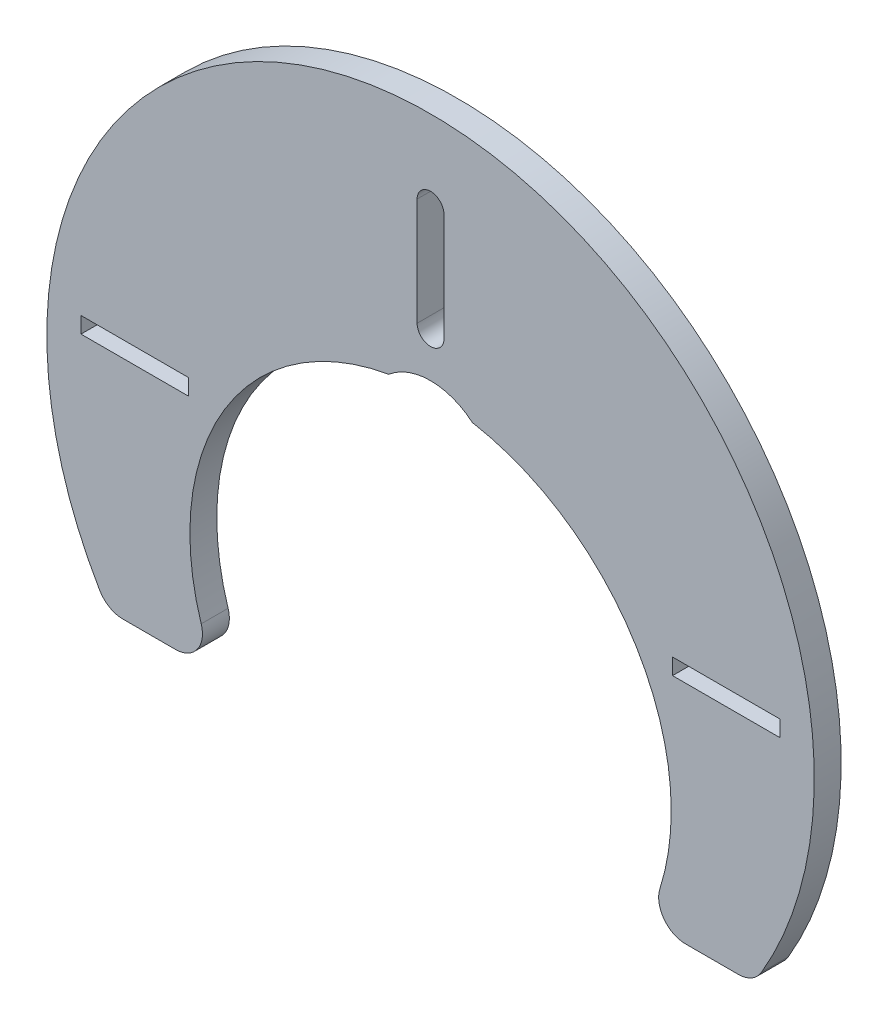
ISO-10303-21;
HEADER;
FILE_DESCRIPTION(('STEP AP214'),'2;1');
FILE_NAME('part.step','',(''),(''),'','','');
FILE_SCHEMA(('AUTOMOTIVE_DESIGN { 1 0 10303 214 1 1 1 1 }'));
ENDSEC;
DATA;
#1=APPLICATION_CONTEXT('core data for automotive mechanical design processes');
#2=APPLICATION_PROTOCOL_DEFINITION('international standard','automotive_design',2000,#1);
#3=PRODUCT_CONTEXT('',#1,'mechanical');
#4=PRODUCT('Part','Part','',(#3));
#5=PRODUCT_RELATED_PRODUCT_CATEGORY('part','',(#4));
#6=PRODUCT_DEFINITION_FORMATION('','',#4);
#7=PRODUCT_DEFINITION_CONTEXT('part definition',#1,'design');
#8=PRODUCT_DEFINITION('design','',#6,#7);
#9=PRODUCT_DEFINITION_SHAPE('','',#8);
#10=(LENGTH_UNIT() NAMED_UNIT(*) SI_UNIT(.MILLI.,.METRE.));
#11=(NAMED_UNIT(*) PLANE_ANGLE_UNIT() SI_UNIT($,.RADIAN.));
#12=(NAMED_UNIT(*) SI_UNIT($,.STERADIAN.) SOLID_ANGLE_UNIT());
#13=UNCERTAINTY_MEASURE_WITH_UNIT(LENGTH_MEASURE(1.E-05),#10,'distance_accuracy_value','');
#14=(GEOMETRIC_REPRESENTATION_CONTEXT(3) GLOBAL_UNCERTAINTY_ASSIGNED_CONTEXT((#13)) GLOBAL_UNIT_ASSIGNED_CONTEXT((#10,
#11,#12)) REPRESENTATION_CONTEXT('',''));
#15=CARTESIAN_POINT('',(0.,0.,0.));
#16=DIRECTION('',(0.,0.,1.));
#17=DIRECTION('',(1.,0.,0.));
#18=AXIS2_PLACEMENT_3D('',#15,#16,#17);
#19=CARTESIAN_POINT('',(-1.5997211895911,-10.4141067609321,5.));
#20=DIRECTION('',(0.,0.,-1.));
#21=DIRECTION('',(-1.,0.,0.));
#22=AXIS2_PLACEMENT_3D('',#19,#20,#21);
#23=CYLINDRICAL_SURFACE('',#22,44.7545011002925);
#24=CARTESIAN_POINT('',(-1.5997211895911,-10.4141067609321,0.));
#25=DIRECTION('',(0.,0.,-1.));
#26=DIRECTION('',(-1.,0.,0.));
#27=AXIS2_PLACEMENT_3D('',#24,#25,#26);
#28=CIRCLE('',#27,44.7545011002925);
#29=CARTESIAN_POINT('',(6.16424102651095,33.6618079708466,0.));
#30=VERTEX_POINT('',#29);
#31=CARTESIAN_POINT('',(41.0513579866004,-23.9732665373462,0.));
#32=VERTEX_POINT('',#31);
#33=EDGE_CURVE('E281',#30,#32,#28,.T.);
#34=ORIENTED_EDGE('',*,*,#33,.T.);
#35=DIRECTION('',(0.,0.,-1.));
#36=VECTOR('',#35,1.);
#37=CARTESIAN_POINT('',(41.0513579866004,-23.9732665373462,5.));
#38=LINE('',#37,#36);
#39=CARTESIAN_POINT('',(41.0513579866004,-23.9732665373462,5.));
#40=VERTEX_POINT('',#39);
#41=EDGE_CURVE('E206',#32,#40,#38,.F.);
#42=ORIENTED_EDGE('',*,*,#41,.T.);
#43=CARTESIAN_POINT('',(-1.5997211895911,-10.4141067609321,5.));
#44=DIRECTION('',(0.,0.,-1.));
#45=DIRECTION('',(-1.,0.,0.));
#46=AXIS2_PLACEMENT_3D('',#43,#44,#45);
#47=CIRCLE('',#46,44.7545011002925);
#48=CARTESIAN_POINT('',(6.16424102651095,33.6618079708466,5.));
#49=VERTEX_POINT('',#48);
#50=EDGE_CURVE('E200',#49,#40,#47,.T.);
#51=ORIENTED_EDGE('',*,*,#50,.F.);
#52=DIRECTION('',(0.,0.,1.));
#53=VECTOR('',#52,1.);
#54=CARTESIAN_POINT('',(6.16424102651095,33.6618079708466,2.));
#55=LINE('',#54,#53);
#56=EDGE_CURVE('E182',#49,#30,#55,.F.);
#57=ORIENTED_EDGE('',*,*,#56,.T.);
#58=EDGE_LOOP('',(#34,#42,#51,#57));
#59=FACE_BOUND('',#58,.T.);
#60=ADVANCED_FACE('F31',(#59),#23,.F.);
#61=CARTESIAN_POINT('',(-1.59972118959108,8.1333026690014,5.));
#62=DIRECTION('',(0.,0.,-1.));
#63=DIRECTION('',(-1.,0.,0.));
#64=AXIS2_PLACEMENT_3D('',#61,#62,#63);
#65=CYLINDRICAL_SURFACE('',#64,71.3555397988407);
#66=CARTESIAN_POINT('',(-1.59972118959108,8.1333026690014,5.));
#67=DIRECTION('',(0.,0.,1.));
#68=DIRECTION('',(-1.,0.,0.));
#69=AXIS2_PLACEMENT_3D('',#66,#67,#68);
#70=CIRCLE('',#69,71.3555397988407);
#71=CARTESIAN_POINT('',(59.9180886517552,-28.0215328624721,5.));
#72=VERTEX_POINT('',#71);
#73=CARTESIAN_POINT('',(-63.1175310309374,-28.0215328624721,5.));
#74=VERTEX_POINT('',#73);
#75=EDGE_CURVE('E210',#72,#74,#70,.T.);
#76=ORIENTED_EDGE('',*,*,#75,.F.);
#77=DIRECTION('',(0.,0.,-1.));
#78=VECTOR('',#77,1.);
#79=CARTESIAN_POINT('',(59.9180886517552,-28.0215328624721,5.));
#80=LINE('',#79,#78);
#81=CARTESIAN_POINT('',(59.9180886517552,-28.0215328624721,0.));
#82=VERTEX_POINT('',#81);
#83=EDGE_CURVE('E245',#72,#82,#80,.T.);
#84=ORIENTED_EDGE('',*,*,#83,.T.);
#85=CARTESIAN_POINT('',(-1.59972118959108,8.1333026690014,0.));
#86=DIRECTION('',(0.,0.,1.));
#87=DIRECTION('',(-1.,0.,0.));
#88=AXIS2_PLACEMENT_3D('',#85,#86,#87);
#89=CIRCLE('',#88,71.3555397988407);
#90=CARTESIAN_POINT('',(-63.1175310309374,-28.0215328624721,0.));
#91=VERTEX_POINT('',#90);
#92=EDGE_CURVE('E282',#82,#91,#89,.T.);
#93=ORIENTED_EDGE('',*,*,#92,.T.);
#94=DIRECTION('',(0.,0.,-1.));
#95=VECTOR('',#94,1.);
#96=CARTESIAN_POINT('',(-63.1175310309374,-28.0215328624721,5.));
#97=LINE('',#96,#95);
#98=EDGE_CURVE('E243',#91,#74,#97,.F.);
#99=ORIENTED_EDGE('',*,*,#98,.T.);
#100=EDGE_LOOP('',(#76,#84,#93,#99));
#101=FACE_BOUND('',#100,.T.);
#102=ADVANCED_FACE('F33',(#101),#65,.T.);
#103=CARTESIAN_POINT('',(-61.5997211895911,-30.4881040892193,5.));
#104=DIRECTION('',(0.,1.,0.));
#105=DIRECTION('',(0.,0.,1.));
#106=AXIS2_PLACEMENT_3D('',#103,#104,#105);
#107=PLANE('',#106);
#108=DIRECTION('',(1.,0.,0.));
#109=VECTOR('',#108,1.);
#110=CARTESIAN_POINT('',(-61.5997211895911,-30.4881040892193,5.));
#111=LINE('',#110,#109);
#112=CARTESIAN_POINT('',(-58.8068769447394,-30.4881040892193,5.));
#113=VERTEX_POINT('',#112);
#114=CARTESIAN_POINT('',(-49.0158047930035,-30.4881040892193,5.));
#115=VERTEX_POINT('',#114);
#116=EDGE_CURVE('E207',#113,#115,#111,.T.);
#117=ORIENTED_EDGE('',*,*,#116,.F.);
#118=DIRECTION('',(0.,0.,-1.));
#119=VECTOR('',#118,1.);
#120=CARTESIAN_POINT('',(-58.8068769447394,-30.4881040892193,5.));
#121=LINE('',#120,#119);
#122=CARTESIAN_POINT('',(-58.8068769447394,-30.4881040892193,0.));
#123=VERTEX_POINT('',#122);
#124=EDGE_CURVE('E39',#113,#123,#121,.T.);
#125=ORIENTED_EDGE('',*,*,#124,.T.);
#126=DIRECTION('',(1.,0.,0.));
#127=VECTOR('',#126,1.);
#128=CARTESIAN_POINT('',(-61.5997211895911,-30.4881040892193,0.));
#129=LINE('',#128,#127);
#130=CARTESIAN_POINT('',(-49.0158047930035,-30.4881040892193,0.));
#131=VERTEX_POINT('',#130);
#132=EDGE_CURVE('E273',#123,#131,#129,.T.);
#133=ORIENTED_EDGE('',*,*,#132,.T.);
#134=DIRECTION('',(0.,0.,-1.));
#135=VECTOR('',#134,1.);
#136=CARTESIAN_POINT('',(-49.0158047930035,-30.4881040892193,5.));
#137=LINE('',#136,#135);
#138=EDGE_CURVE('E46',#131,#115,#137,.F.);
#139=ORIENTED_EDGE('',*,*,#138,.T.);
#140=EDGE_LOOP('',(#117,#125,#133,#139));
#141=FACE_BOUND('',#140,.T.);
#142=ADVANCED_FACE('F272',(#141),#107,.F.);
#143=CARTESIAN_POINT('',(-44.2508003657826,-23.9732665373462,5.));
#144=VERTEX_POINT('',#143);
#145=CARTESIAN_POINT('',(-9.36368340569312,33.6618079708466,5.));
#146=VERTEX_POINT('',#145);
#147=EDGE_CURVE('E203',#144,#146,#47,.T.);
#148=ORIENTED_EDGE('',*,*,#147,.F.);
#149=DIRECTION('',(0.,0.,-1.));
#150=VECTOR('',#149,1.);
#151=CARTESIAN_POINT('',(-44.2508003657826,-23.9732665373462,5.));
#152=LINE('',#151,#150);
#153=CARTESIAN_POINT('',(-44.2508003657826,-23.9732665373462,0.));
#154=VERTEX_POINT('',#153);
#155=EDGE_CURVE('E11',#144,#154,#152,.T.);
#156=ORIENTED_EDGE('',*,*,#155,.T.);
#157=CARTESIAN_POINT('',(-9.36368340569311,33.6618079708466,0.));
#158=VERTEX_POINT('',#157);
#159=EDGE_CURVE('E284',#154,#158,#28,.T.);
#160=ORIENTED_EDGE('',*,*,#159,.T.);
#161=DIRECTION('',(0.,0.,1.));
#162=VECTOR('',#161,1.);
#163=CARTESIAN_POINT('',(-9.36368340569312,33.6618079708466,2.));
#164=LINE('',#163,#162);
#165=EDGE_CURVE('E195',#158,#146,#164,.T.);
#166=ORIENTED_EDGE('',*,*,#165,.T.);
#167=EDGE_LOOP('',(#148,#156,#160,#166));
#168=FACE_BOUND('',#167,.T.);
#169=ADVANCED_FACE('F320',(#168),#23,.F.);
#170=CARTESIAN_POINT('',(38.4002788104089,-30.4881040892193,5.));
#171=DIRECTION('',(0.,1.,0.));
#172=DIRECTION('',(0.,0.,1.));
#173=AXIS2_PLACEMENT_3D('',#170,#171,#172);
#174=PLANE('',#173);
#175=DIRECTION('',(1.,0.,0.));
#176=VECTOR('',#175,1.);
#177=CARTESIAN_POINT('',(38.4002788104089,-30.4881040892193,0.));
#178=LINE('',#177,#176);
#179=CARTESIAN_POINT('',(45.8163624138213,-30.4881040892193,0.));
#180=VERTEX_POINT('',#179);
#181=CARTESIAN_POINT('',(55.6074345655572,-30.4881040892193,0.));
#182=VERTEX_POINT('',#181);
#183=EDGE_CURVE('E290',#180,#182,#178,.T.);
#184=ORIENTED_EDGE('',*,*,#183,.T.);
#185=DIRECTION('',(0.,0.,-1.));
#186=VECTOR('',#185,1.);
#187=CARTESIAN_POINT('',(55.6074345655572,-30.4881040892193,5.));
#188=LINE('',#187,#186);
#189=CARTESIAN_POINT('',(55.6074345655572,-30.4881040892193,5.));
#190=VERTEX_POINT('',#189);
#191=EDGE_CURVE('E259',#182,#190,#188,.F.);
#192=ORIENTED_EDGE('',*,*,#191,.T.);
#193=DIRECTION('',(1.,0.,0.));
#194=VECTOR('',#193,1.);
#195=CARTESIAN_POINT('',(38.4002788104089,-30.4881040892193,5.));
#196=LINE('',#195,#194);
#197=CARTESIAN_POINT('',(45.8163624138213,-30.4881040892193,5.));
#198=VERTEX_POINT('',#197);
#199=EDGE_CURVE('E209',#198,#190,#196,.T.);
#200=ORIENTED_EDGE('',*,*,#199,.F.);
#201=DIRECTION('',(0.,0.,-1.));
#202=VECTOR('',#201,1.);
#203=CARTESIAN_POINT('',(45.8163624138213,-30.4881040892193,5.));
#204=LINE('',#203,#202);
#205=EDGE_CURVE('E256',#198,#180,#204,.T.);
#206=ORIENTED_EDGE('',*,*,#205,.T.);
#207=EDGE_LOOP('',(#184,#192,#200,#206));
#208=FACE_BOUND('',#207,.T.);
#209=ADVANCED_FACE('F302',(#208),#174,.F.);
#210=CARTESIAN_POINT('',(-1.59972118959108,8.1333026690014,5.));
#211=DIRECTION('',(0.,0.,-1.));
#212=DIRECTION('',(-1.,0.,0.));
#213=AXIS2_PLACEMENT_3D('',#210,#211,#212);
#214=PLANE('',#213);
#215=DIRECTION('',(0.,-1.,0.));
#216=VECTOR('',#215,1.);
#217=CARTESIAN_POINT('',(-4.09972118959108,64.5118959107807,5.));
#218=LINE('',#217,#216);
#219=CARTESIAN_POINT('',(-4.09972118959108,64.5118959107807,5.));
#220=VERTEX_POINT('',#219);
#221=CARTESIAN_POINT('',(-4.09972118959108,44.5118959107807,5.));
#222=VERTEX_POINT('',#221);
#223=EDGE_CURVE('E483',#220,#222,#218,.T.);
#224=ORIENTED_EDGE('',*,*,#223,.F.);
#225=CARTESIAN_POINT('',(-1.59972118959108,64.5118959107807,5.));
#226=DIRECTION('',(0.,0.,1.));
#227=DIRECTION('',(-1.,0.,0.));
#228=AXIS2_PLACEMENT_3D('',#225,#226,#227);
#229=CIRCLE('',#228,2.5);
#230=CARTESIAN_POINT('',(0.900278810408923,64.5118959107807,5.));
#231=VERTEX_POINT('',#230);
#232=EDGE_CURVE('E194',#231,#220,#229,.T.);
#233=ORIENTED_EDGE('',*,*,#232,.F.);
#234=DIRECTION('',(0.,1.,0.));
#235=VECTOR('',#234,1.);
#236=CARTESIAN_POINT('',(0.900278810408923,64.5118959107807,5.));
#237=LINE('',#236,#235);
#238=CARTESIAN_POINT('',(0.900278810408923,44.5118959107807,5.));
#239=VERTEX_POINT('',#238);
#240=EDGE_CURVE('E544',#239,#231,#237,.T.);
#241=ORIENTED_EDGE('',*,*,#240,.F.);
#242=CARTESIAN_POINT('',(-1.59972118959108,44.5118959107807,5.));
#243=DIRECTION('',(0.,0.,1.));
#244=DIRECTION('',(1.,0.,0.));
#245=AXIS2_PLACEMENT_3D('',#242,#243,#244);
#246=CIRCLE('',#245,2.5);
#247=EDGE_CURVE('E551',#222,#239,#246,.T.);
#248=ORIENTED_EDGE('',*,*,#247,.F.);
#249=EDGE_LOOP('',(#224,#233,#241,#248));
#250=FACE_BOUND('',#249,.T.);
#251=DIRECTION('',(0.,-1.,0.));
#252=VECTOR('',#251,1.);
#253=CARTESIAN_POINT('',(43.4002788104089,14.5118959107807,5.));
#254=LINE('',#253,#252);
#255=CARTESIAN_POINT('',(43.4002788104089,14.5118959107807,5.));
#256=VERTEX_POINT('',#255);
#257=CARTESIAN_POINT('',(43.4002788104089,11.5118959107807,5.));
#258=VERTEX_POINT('',#257);
#259=EDGE_CURVE('E489',#256,#258,#254,.T.);
#260=ORIENTED_EDGE('',*,*,#259,.F.);
#261=DIRECTION('',(-1.,0.,0.));
#262=VECTOR('',#261,1.);
#263=CARTESIAN_POINT('',(43.4002788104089,14.5118959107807,5.));
#264=LINE('',#263,#262);
#265=CARTESIAN_POINT('',(63.4002788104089,14.5118959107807,5.));
#266=VERTEX_POINT('',#265);
#267=EDGE_CURVE('E537',#266,#256,#264,.T.);
#268=ORIENTED_EDGE('',*,*,#267,.F.);
#269=DIRECTION('',(0.,1.,0.));
#270=VECTOR('',#269,1.);
#271=CARTESIAN_POINT('',(63.4002788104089,14.5118959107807,5.));
#272=LINE('',#271,#270);
#273=CARTESIAN_POINT('',(63.4002788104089,11.5118959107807,5.));
#274=VERTEX_POINT('',#273);
#275=EDGE_CURVE('E526',#274,#266,#272,.T.);
#276=ORIENTED_EDGE('',*,*,#275,.F.);
#277=DIRECTION('',(1.,0.,0.));
#278=VECTOR('',#277,1.);
#279=CARTESIAN_POINT('',(43.4002788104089,11.5118959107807,5.));
#280=LINE('',#279,#278);
#281=EDGE_CURVE('E533',#258,#274,#280,.T.);
#282=ORIENTED_EDGE('',*,*,#281,.F.);
#283=EDGE_LOOP('',(#260,#268,#276,#282));
#284=FACE_BOUND('',#283,.T.);
#285=DIRECTION('',(1.,0.,0.));
#286=VECTOR('',#285,1.);
#287=CARTESIAN_POINT('',(-66.5997211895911,11.5118959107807,5.));
#288=LINE('',#287,#286);
#289=CARTESIAN_POINT('',(-66.5997211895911,11.5118959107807,5.));
#290=VERTEX_POINT('',#289);
#291=CARTESIAN_POINT('',(-46.5997211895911,11.5118959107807,5.));
#292=VERTEX_POINT('',#291);
#293=EDGE_CURVE('E494',#290,#292,#288,.T.);
#294=ORIENTED_EDGE('',*,*,#293,.F.);
#295=DIRECTION('',(0.,-1.,0.));
#296=VECTOR('',#295,1.);
#297=CARTESIAN_POINT('',(-66.5997211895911,14.5118959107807,5.));
#298=LINE('',#297,#296);
#299=CARTESIAN_POINT('',(-66.5997211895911,14.5118959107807,5.));
#300=VERTEX_POINT('',#299);
#301=EDGE_CURVE('E496',#300,#290,#298,.T.);
#302=ORIENTED_EDGE('',*,*,#301,.F.);
#303=DIRECTION('',(-1.,0.,0.));
#304=VECTOR('',#303,1.);
#305=CARTESIAN_POINT('',(-66.5997211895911,14.5118959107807,5.));
#306=LINE('',#305,#304);
#307=CARTESIAN_POINT('',(-46.5997211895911,14.5118959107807,5.));
#308=VERTEX_POINT('',#307);
#309=EDGE_CURVE('E501',#308,#300,#306,.T.);
#310=ORIENTED_EDGE('',*,*,#309,.F.);
#311=DIRECTION('',(0.,1.,0.));
#312=VECTOR('',#311,1.);
#313=CARTESIAN_POINT('',(-46.5997211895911,14.5118959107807,5.));
#314=LINE('',#313,#312);
#315=EDGE_CURVE('E498',#292,#308,#314,.T.);
#316=ORIENTED_EDGE('',*,*,#315,.F.);
#317=EDGE_LOOP('',(#294,#302,#310,#316));
#318=FACE_BOUND('',#317,.T.);
#319=ORIENTED_EDGE('',*,*,#199,.T.);
#320=CARTESIAN_POINT('',(55.6074345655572,-25.4881040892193,5.));
#321=DIRECTION('',(0.,0.,-1.));
#322=DIRECTION('',(-1.,0.,0.));
#323=AXIS2_PLACEMENT_3D('',#320,#321,#322);
#324=CIRCLE('',#323,5.);
#325=EDGE_CURVE('E266',#190,#72,#324,.F.);
#326=ORIENTED_EDGE('',*,*,#325,.T.);
#327=ORIENTED_EDGE('',*,*,#75,.T.);
#328=CARTESIAN_POINT('',(-58.8068769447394,-25.4881040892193,5.));
#329=DIRECTION('',(0.,0.,-1.));
#330=DIRECTION('',(-1.,0.,0.));
#331=AXIS2_PLACEMENT_3D('',#328,#329,#330);
#332=CIRCLE('',#331,5.);
#333=EDGE_CURVE('E53',#74,#113,#332,.F.);
#334=ORIENTED_EDGE('',*,*,#333,.T.);
#335=ORIENTED_EDGE('',*,*,#116,.T.);
#336=CARTESIAN_POINT('',(-49.0158047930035,-25.4881040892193,5.));
#337=DIRECTION('',(0.,0.,-1.));
#338=DIRECTION('',(-1.,0.,0.));
#339=AXIS2_PLACEMENT_3D('',#336,#337,#338);
#340=CIRCLE('',#339,5.);
#341=EDGE_CURVE('E261',#115,#144,#340,.F.);
#342=ORIENTED_EDGE('',*,*,#341,.T.);
#343=ORIENTED_EDGE('',*,*,#147,.T.);
#344=CARTESIAN_POINT('',(-1.59972118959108,24.5118959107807,5.));
#345=DIRECTION('',(0.,0.,1.));
#346=DIRECTION('',(1.,0.,0.));
#347=AXIS2_PLACEMENT_3D('',#344,#345,#346);
#348=CIRCLE('',#347,12.);
#349=EDGE_CURVE('E186',#49,#146,#348,.T.);
#350=ORIENTED_EDGE('',*,*,#349,.F.);
#351=ORIENTED_EDGE('',*,*,#50,.T.);
#352=CARTESIAN_POINT('',(45.8163624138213,-25.4881040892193,5.));
#353=DIRECTION('',(0.,0.,-1.));
#354=DIRECTION('',(-1.,0.,0.));
#355=AXIS2_PLACEMENT_3D('',#352,#353,#354);
#356=CIRCLE('',#355,5.);
#357=EDGE_CURVE('E264',#40,#198,#356,.F.);
#358=ORIENTED_EDGE('',*,*,#357,.T.);
#359=EDGE_LOOP('',(#319,#326,#327,#334,#335,#342,#343,#350,#351,#358));
#360=FACE_BOUND('',#359,.T.);
#361=ADVANCED_FACE('F199',(#250,#284,#318,#360),#214,.F.);
#362=CARTESIAN_POINT('',(-1.59972118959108,8.1333026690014,0.));
#363=DIRECTION('',(0.,0.,-1.));
#364=DIRECTION('',(-1.,0.,0.));
#365=AXIS2_PLACEMENT_3D('',#362,#363,#364);
#366=PLANE('',#365);
#367=ORIENTED_EDGE('',*,*,#92,.F.);
#368=CARTESIAN_POINT('',(55.6074345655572,-25.4881040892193,0.));
#369=DIRECTION('',(0.,0.,-1.));
#370=DIRECTION('',(-1.,0.,0.));
#371=AXIS2_PLACEMENT_3D('',#368,#369,#370);
#372=CIRCLE('',#371,5.);
#373=EDGE_CURVE('E254',#82,#182,#372,.T.);
#374=ORIENTED_EDGE('',*,*,#373,.T.);
#375=ORIENTED_EDGE('',*,*,#183,.F.);
#376=CARTESIAN_POINT('',(45.8163624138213,-25.4881040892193,0.));
#377=DIRECTION('',(0.,0.,-1.));
#378=DIRECTION('',(-1.,0.,0.));
#379=AXIS2_PLACEMENT_3D('',#376,#377,#378);
#380=CIRCLE('',#379,5.);
#381=EDGE_CURVE('E252',#180,#32,#380,.T.);
#382=ORIENTED_EDGE('',*,*,#381,.T.);
#383=ORIENTED_EDGE('',*,*,#33,.F.);
#384=CARTESIAN_POINT('',(-1.59972118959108,24.5118959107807,0.));
#385=DIRECTION('',(0.,0.,-1.));
#386=DIRECTION('',(-1.,0.,0.));
#387=AXIS2_PLACEMENT_3D('',#384,#385,#386);
#388=CIRCLE('',#387,12.);
#389=EDGE_CURVE('E189',#158,#30,#388,.T.);
#390=ORIENTED_EDGE('',*,*,#389,.F.);
#391=ORIENTED_EDGE('',*,*,#159,.F.);
#392=CARTESIAN_POINT('',(-49.0158047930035,-25.4881040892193,0.));
#393=DIRECTION('',(0.,0.,-1.));
#394=DIRECTION('',(-1.,0.,0.));
#395=AXIS2_PLACEMENT_3D('',#392,#393,#394);
#396=CIRCLE('',#395,5.);
#397=EDGE_CURVE('E248',#154,#131,#396,.T.);
#398=ORIENTED_EDGE('',*,*,#397,.T.);
#399=ORIENTED_EDGE('',*,*,#132,.F.);
#400=CARTESIAN_POINT('',(-58.8068769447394,-25.4881040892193,0.));
#401=DIRECTION('',(0.,0.,-1.));
#402=DIRECTION('',(-1.,0.,0.));
#403=AXIS2_PLACEMENT_3D('',#400,#401,#402);
#404=CIRCLE('',#403,5.);
#405=EDGE_CURVE('E250',#123,#91,#404,.T.);
#406=ORIENTED_EDGE('',*,*,#405,.T.);
#407=EDGE_LOOP('',(#367,#374,#375,#382,#383,#390,#391,#398,#399,#406));
#408=FACE_BOUND('',#407,.T.);
#409=CARTESIAN_POINT('',(-1.59972118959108,64.5118959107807,0.));
#410=DIRECTION('',(0.,0.,-1.));
#411=DIRECTION('',(-1.,0.,0.));
#412=AXIS2_PLACEMENT_3D('',#409,#410,#411);
#413=CIRCLE('',#412,2.5);
#414=CARTESIAN_POINT('',(-4.09972118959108,64.5118959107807,0.));
#415=VERTEX_POINT('',#414);
#416=CARTESIAN_POINT('',(0.900278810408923,64.5118959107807,0.));
#417=VERTEX_POINT('',#416);
#418=EDGE_CURVE('E240',#415,#417,#413,.T.);
#419=ORIENTED_EDGE('',*,*,#418,.F.);
#420=DIRECTION('',(0.,1.,0.));
#421=VECTOR('',#420,1.);
#422=CARTESIAN_POINT('',(-4.09972118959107,8.1333026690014,0.));
#423=LINE('',#422,#421);
#424=CARTESIAN_POINT('',(-4.09972118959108,44.5118959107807,0.));
#425=VERTEX_POINT('',#424);
#426=EDGE_CURVE('E233',#425,#415,#423,.T.);
#427=ORIENTED_EDGE('',*,*,#426,.F.);
#428=CARTESIAN_POINT('',(-1.59972118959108,44.5118959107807,0.));
#429=DIRECTION('',(0.,0.,-1.));
#430=DIRECTION('',(-1.,0.,0.));
#431=AXIS2_PLACEMENT_3D('',#428,#429,#430);
#432=CIRCLE('',#431,2.5);
#433=CARTESIAN_POINT('',(0.900278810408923,44.5118959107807,0.));
#434=VERTEX_POINT('',#433);
#435=EDGE_CURVE('E235',#434,#425,#432,.T.);
#436=ORIENTED_EDGE('',*,*,#435,.F.);
#437=DIRECTION('',(0.,-1.,0.));
#438=VECTOR('',#437,1.);
#439=CARTESIAN_POINT('',(0.90027881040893,8.1333026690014,0.));
#440=LINE('',#439,#438);
#441=EDGE_CURVE('E238',#417,#434,#440,.T.);
#442=ORIENTED_EDGE('',*,*,#441,.F.);
#443=EDGE_LOOP('',(#419,#427,#436,#442));
#444=FACE_BOUND('',#443,.T.);
#445=DIRECTION('',(1.,0.,0.));
#446=VECTOR('',#445,1.);
#447=CARTESIAN_POINT('',(-1.59972118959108,14.5118959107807,0.));
#448=LINE('',#447,#446);
#449=CARTESIAN_POINT('',(43.4002788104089,14.5118959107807,0.));
#450=VERTEX_POINT('',#449);
#451=CARTESIAN_POINT('',(63.4002788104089,14.5118959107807,0.));
#452=VERTEX_POINT('',#451);
#453=EDGE_CURVE('E231',#450,#452,#448,.T.);
#454=ORIENTED_EDGE('',*,*,#453,.F.);
#455=DIRECTION('',(0.,1.,0.));
#456=VECTOR('',#455,1.);
#457=CARTESIAN_POINT('',(43.4002788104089,8.1333026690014,0.));
#458=LINE('',#457,#456);
#459=CARTESIAN_POINT('',(43.4002788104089,11.5118959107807,0.));
#460=VERTEX_POINT('',#459);
#461=EDGE_CURVE('E224',#460,#450,#458,.T.);
#462=ORIENTED_EDGE('',*,*,#461,.F.);
#463=DIRECTION('',(-1.,0.,0.));
#464=VECTOR('',#463,1.);
#465=CARTESIAN_POINT('',(-1.59972118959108,11.5118959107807,0.));
#466=LINE('',#465,#464);
#467=CARTESIAN_POINT('',(63.4002788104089,11.5118959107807,0.));
#468=VERTEX_POINT('',#467);
#469=EDGE_CURVE('E226',#468,#460,#466,.T.);
#470=ORIENTED_EDGE('',*,*,#469,.F.);
#471=DIRECTION('',(0.,-1.,0.));
#472=VECTOR('',#471,1.);
#473=CARTESIAN_POINT('',(63.4002788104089,8.1333026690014,0.));
#474=LINE('',#473,#472);
#475=EDGE_CURVE('E229',#452,#468,#474,.T.);
#476=ORIENTED_EDGE('',*,*,#475,.F.);
#477=EDGE_LOOP('',(#454,#462,#470,#476));
#478=FACE_BOUND('',#477,.T.);
#479=DIRECTION('',(0.,1.,0.));
#480=VECTOR('',#479,1.);
#481=CARTESIAN_POINT('',(-66.5997211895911,8.1333026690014,0.));
#482=LINE('',#481,#480);
#483=CARTESIAN_POINT('',(-66.5997211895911,11.5118959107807,0.));
#484=VERTEX_POINT('',#483);
#485=CARTESIAN_POINT('',(-66.5997211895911,14.5118959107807,0.));
#486=VERTEX_POINT('',#485);
#487=EDGE_CURVE('E222',#484,#486,#482,.T.);
#488=ORIENTED_EDGE('',*,*,#487,.F.);
#489=DIRECTION('',(-1.,0.,0.));
#490=VECTOR('',#489,1.);
#491=CARTESIAN_POINT('',(-1.59972118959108,11.5118959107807,0.));
#492=LINE('',#491,#490);
#493=CARTESIAN_POINT('',(-46.5997211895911,11.5118959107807,0.));
#494=VERTEX_POINT('',#493);
#495=EDGE_CURVE('E215',#494,#484,#492,.T.);
#496=ORIENTED_EDGE('',*,*,#495,.F.);
#497=DIRECTION('',(0.,-1.,0.));
#498=VECTOR('',#497,1.);
#499=CARTESIAN_POINT('',(-46.5997211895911,8.1333026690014,0.));
#500=LINE('',#499,#498);
#501=CARTESIAN_POINT('',(-46.5997211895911,14.5118959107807,0.));
#502=VERTEX_POINT('',#501);
#503=EDGE_CURVE('E217',#502,#494,#500,.T.);
#504=ORIENTED_EDGE('',*,*,#503,.F.);
#505=DIRECTION('',(1.,0.,0.));
#506=VECTOR('',#505,1.);
#507=CARTESIAN_POINT('',(-1.59972118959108,14.5118959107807,0.));
#508=LINE('',#507,#506);
#509=EDGE_CURVE('E220',#486,#502,#508,.T.);
#510=ORIENTED_EDGE('',*,*,#509,.F.);
#511=EDGE_LOOP('',(#488,#496,#504,#510));
#512=FACE_BOUND('',#511,.T.);
#513=ADVANCED_FACE('F277',(#408,#444,#478,#512),#366,.T.);
#514=CARTESIAN_POINT('',(-66.5997211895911,14.5118959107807,-1.));
#515=DIRECTION('',(-1.,0.,0.));
#516=DIRECTION('',(0.,0.,1.));
#517=AXIS2_PLACEMENT_3D('',#514,#515,#516);
#518=PLANE('',#517);
#519=ORIENTED_EDGE('',*,*,#487,.T.);
#520=DIRECTION('',(0.,0.,1.));
#521=VECTOR('',#520,1.);
#522=CARTESIAN_POINT('',(-66.5997211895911,14.5118959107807,-1.));
#523=LINE('',#522,#521);
#524=EDGE_CURVE('E286',#486,#300,#523,.T.);
#525=ORIENTED_EDGE('',*,*,#524,.T.);
#526=ORIENTED_EDGE('',*,*,#301,.T.);
#527=DIRECTION('',(0.,0.,1.));
#528=VECTOR('',#527,1.);
#529=CARTESIAN_POINT('',(-66.5997211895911,11.5118959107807,-1.));
#530=LINE('',#529,#528);
#531=EDGE_CURVE('E509',#484,#290,#530,.T.);
#532=ORIENTED_EDGE('',*,*,#531,.F.);
#533=EDGE_LOOP('',(#519,#525,#526,#532));
#534=FACE_BOUND('',#533,.T.);
#535=ADVANCED_FACE('F440',(#534),#518,.F.);
#536=CARTESIAN_POINT('',(-66.5997211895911,14.5118959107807,-1.));
#537=DIRECTION('',(0.,1.,0.));
#538=DIRECTION('',(-1.,0.,0.));
#539=AXIS2_PLACEMENT_3D('',#536,#537,#538);
#540=PLANE('',#539);
#541=ORIENTED_EDGE('',*,*,#509,.T.);
#542=DIRECTION('',(0.,0.,1.));
#543=VECTOR('',#542,1.);
#544=CARTESIAN_POINT('',(-46.5997211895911,14.5118959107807,-1.));
#545=LINE('',#544,#543);
#546=EDGE_CURVE('E511',#502,#308,#545,.T.);
#547=ORIENTED_EDGE('',*,*,#546,.T.);
#548=ORIENTED_EDGE('',*,*,#309,.T.);
#549=ORIENTED_EDGE('',*,*,#524,.F.);
#550=EDGE_LOOP('',(#541,#547,#548,#549));
#551=FACE_BOUND('',#550,.T.);
#552=ADVANCED_FACE('F432',(#551),#540,.F.);
#553=CARTESIAN_POINT('',(-46.5997211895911,14.5118959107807,-1.));
#554=DIRECTION('',(1.,0.,0.));
#555=DIRECTION('',(0.,0.,-1.));
#556=AXIS2_PLACEMENT_3D('',#553,#554,#555);
#557=PLANE('',#556);
#558=ORIENTED_EDGE('',*,*,#503,.T.);
#559=DIRECTION('',(0.,0.,1.));
#560=VECTOR('',#559,1.);
#561=CARTESIAN_POINT('',(-46.5997211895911,11.5118959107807,-1.));
#562=LINE('',#561,#560);
#563=EDGE_CURVE('E513',#494,#292,#562,.T.);
#564=ORIENTED_EDGE('',*,*,#563,.T.);
#565=ORIENTED_EDGE('',*,*,#315,.T.);
#566=ORIENTED_EDGE('',*,*,#546,.F.);
#567=EDGE_LOOP('',(#558,#564,#565,#566));
#568=FACE_BOUND('',#567,.T.);
#569=ADVANCED_FACE('F424',(#568),#557,.F.);
#570=CARTESIAN_POINT('',(-66.5997211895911,11.5118959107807,-1.));
#571=DIRECTION('',(0.,-1.,0.));
#572=DIRECTION('',(0.,0.,-1.));
#573=AXIS2_PLACEMENT_3D('',#570,#571,#572);
#574=PLANE('',#573);
#575=ORIENTED_EDGE('',*,*,#495,.T.);
#576=ORIENTED_EDGE('',*,*,#531,.T.);
#577=ORIENTED_EDGE('',*,*,#293,.T.);
#578=ORIENTED_EDGE('',*,*,#563,.F.);
#579=EDGE_LOOP('',(#575,#576,#577,#578));
#580=FACE_BOUND('',#579,.T.);
#581=ADVANCED_FACE('F416',(#580),#574,.F.);
#582=CARTESIAN_POINT('',(43.4002788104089,14.5118959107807,-1.));
#583=DIRECTION('',(0.,1.,0.));
#584=DIRECTION('',(-1.,0.,0.));
#585=AXIS2_PLACEMENT_3D('',#582,#583,#584);
#586=PLANE('',#585);
#587=ORIENTED_EDGE('',*,*,#453,.T.);
#588=DIRECTION('',(0.,0.,1.));
#589=VECTOR('',#588,1.);
#590=CARTESIAN_POINT('',(63.4002788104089,14.5118959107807,-1.));
#591=LINE('',#590,#589);
#592=EDGE_CURVE('E503',#452,#266,#591,.T.);
#593=ORIENTED_EDGE('',*,*,#592,.T.);
#594=ORIENTED_EDGE('',*,*,#267,.T.);
#595=DIRECTION('',(0.,0.,1.));
#596=VECTOR('',#595,1.);
#597=CARTESIAN_POINT('',(43.4002788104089,14.5118959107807,-1.));
#598=LINE('',#597,#596);
#599=EDGE_CURVE('E522',#450,#256,#598,.T.);
#600=ORIENTED_EDGE('',*,*,#599,.F.);
#601=EDGE_LOOP('',(#587,#593,#594,#600));
#602=FACE_BOUND('',#601,.T.);
#603=ADVANCED_FACE('F408',(#602),#586,.F.);
#604=CARTESIAN_POINT('',(63.4002788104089,14.5118959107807,-1.));
#605=DIRECTION('',(1.,0.,0.));
#606=DIRECTION('',(0.,0.,-1.));
#607=AXIS2_PLACEMENT_3D('',#604,#605,#606);
#608=PLANE('',#607);
#609=ORIENTED_EDGE('',*,*,#475,.T.);
#610=DIRECTION('',(0.,0.,1.));
#611=VECTOR('',#610,1.);
#612=CARTESIAN_POINT('',(63.4002788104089,11.5118959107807,-1.));
#613=LINE('',#612,#611);
#614=EDGE_CURVE('E528',#468,#274,#613,.T.);
#615=ORIENTED_EDGE('',*,*,#614,.T.);
#616=ORIENTED_EDGE('',*,*,#275,.T.);
#617=ORIENTED_EDGE('',*,*,#592,.F.);
#618=EDGE_LOOP('',(#609,#615,#616,#617));
#619=FACE_BOUND('',#618,.T.);
#620=ADVANCED_FACE('F400',(#619),#608,.F.);
#621=CARTESIAN_POINT('',(43.4002788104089,11.5118959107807,-1.));
#622=DIRECTION('',(0.,-1.,0.));
#623=DIRECTION('',(0.,0.,-1.));
#624=AXIS2_PLACEMENT_3D('',#621,#622,#623);
#625=PLANE('',#624);
#626=ORIENTED_EDGE('',*,*,#469,.T.);
#627=DIRECTION('',(0.,0.,1.));
#628=VECTOR('',#627,1.);
#629=CARTESIAN_POINT('',(43.4002788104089,11.5118959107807,-1.));
#630=LINE('',#629,#628);
#631=EDGE_CURVE('E525',#460,#258,#630,.T.);
#632=ORIENTED_EDGE('',*,*,#631,.T.);
#633=ORIENTED_EDGE('',*,*,#281,.T.);
#634=ORIENTED_EDGE('',*,*,#614,.F.);
#635=EDGE_LOOP('',(#626,#632,#633,#634));
#636=FACE_BOUND('',#635,.T.);
#637=ADVANCED_FACE('F392',(#636),#625,.F.);
#638=CARTESIAN_POINT('',(43.4002788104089,14.5118959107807,-1.));
#639=DIRECTION('',(-1.,0.,0.));
#640=DIRECTION('',(0.,0.,1.));
#641=AXIS2_PLACEMENT_3D('',#638,#639,#640);
#642=PLANE('',#641);
#643=ORIENTED_EDGE('',*,*,#461,.T.);
#644=ORIENTED_EDGE('',*,*,#599,.T.);
#645=ORIENTED_EDGE('',*,*,#259,.T.);
#646=ORIENTED_EDGE('',*,*,#631,.F.);
#647=EDGE_LOOP('',(#643,#644,#645,#646));
#648=FACE_BOUND('',#647,.T.);
#649=ADVANCED_FACE('F384',(#648),#642,.F.);
#650=CARTESIAN_POINT('',(-1.59972118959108,64.5118959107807,-1.));
#651=DIRECTION('',(0.,0.,1.));
#652=DIRECTION('',(1.,0.,0.));
#653=AXIS2_PLACEMENT_3D('',#650,#651,#652);
#654=CYLINDRICAL_SURFACE('',#653,2.5);
#655=ORIENTED_EDGE('',*,*,#418,.T.);
#656=DIRECTION('',(0.,0.,1.));
#657=VECTOR('',#656,1.);
#658=CARTESIAN_POINT('',(0.900278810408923,64.5118959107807,-1.));
#659=LINE('',#658,#657);
#660=EDGE_CURVE('E539',#417,#231,#659,.T.);
#661=ORIENTED_EDGE('',*,*,#660,.T.);
#662=ORIENTED_EDGE('',*,*,#232,.T.);
#663=DIRECTION('',(0.,0.,1.));
#664=VECTOR('',#663,1.);
#665=CARTESIAN_POINT('',(-4.09972118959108,64.5118959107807,-1.));
#666=LINE('',#665,#664);
#667=EDGE_CURVE('E540',#415,#220,#666,.T.);
#668=ORIENTED_EDGE('',*,*,#667,.F.);
#669=EDGE_LOOP('',(#655,#661,#662,#668));
#670=FACE_BOUND('',#669,.T.);
#671=ADVANCED_FACE('F376',(#670),#654,.F.);
#672=CARTESIAN_POINT('',(0.900278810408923,64.5118959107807,-1.));
#673=DIRECTION('',(1.,0.,0.));
#674=DIRECTION('',(0.,1.,0.));
#675=AXIS2_PLACEMENT_3D('',#672,#673,#674);
#676=PLANE('',#675);
#677=ORIENTED_EDGE('',*,*,#441,.T.);
#678=DIRECTION('',(0.,0.,1.));
#679=VECTOR('',#678,1.);
#680=CARTESIAN_POINT('',(0.900278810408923,44.5118959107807,-1.));
#681=LINE('',#680,#679);
#682=EDGE_CURVE('E546',#434,#239,#681,.T.);
#683=ORIENTED_EDGE('',*,*,#682,.T.);
#684=ORIENTED_EDGE('',*,*,#240,.T.);
#685=ORIENTED_EDGE('',*,*,#660,.F.);
#686=EDGE_LOOP('',(#677,#683,#684,#685));
#687=FACE_BOUND('',#686,.T.);
#688=ADVANCED_FACE('F368',(#687),#676,.F.);
#689=CARTESIAN_POINT('',(-1.59972118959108,44.5118959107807,-1.));
#690=DIRECTION('',(0.,0.,1.));
#691=DIRECTION('',(1.,0.,0.));
#692=AXIS2_PLACEMENT_3D('',#689,#690,#691);
#693=CYLINDRICAL_SURFACE('',#692,2.5);
#694=ORIENTED_EDGE('',*,*,#435,.T.);
#695=DIRECTION('',(0.,0.,1.));
#696=VECTOR('',#695,1.);
#697=CARTESIAN_POINT('',(-4.09972118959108,44.5118959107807,-1.));
#698=LINE('',#697,#696);
#699=EDGE_CURVE('E543',#425,#222,#698,.T.);
#700=ORIENTED_EDGE('',*,*,#699,.T.);
#701=ORIENTED_EDGE('',*,*,#247,.T.);
#702=ORIENTED_EDGE('',*,*,#682,.F.);
#703=EDGE_LOOP('',(#694,#700,#701,#702));
#704=FACE_BOUND('',#703,.T.);
#705=ADVANCED_FACE('F360',(#704),#693,.F.);
#706=CARTESIAN_POINT('',(-4.09972118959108,64.5118959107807,-1.));
#707=DIRECTION('',(-1.,0.,0.));
#708=DIRECTION('',(0.,-1.,0.));
#709=AXIS2_PLACEMENT_3D('',#706,#707,#708);
#710=PLANE('',#709);
#711=ORIENTED_EDGE('',*,*,#426,.T.);
#712=ORIENTED_EDGE('',*,*,#667,.T.);
#713=ORIENTED_EDGE('',*,*,#223,.T.);
#714=ORIENTED_EDGE('',*,*,#699,.F.);
#715=EDGE_LOOP('',(#711,#712,#713,#714));
#716=FACE_BOUND('',#715,.T.);
#717=ADVANCED_FACE('F316',(#716),#710,.F.);
#718=CARTESIAN_POINT('',(-1.59972118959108,24.5118959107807,-1.));
#719=DIRECTION('',(0.,0.,1.));
#720=DIRECTION('',(1.,0.,0.));
#721=AXIS2_PLACEMENT_3D('',#718,#719,#720);
#722=CYLINDRICAL_SURFACE('',#721,12.);
#723=ORIENTED_EDGE('',*,*,#349,.T.);
#724=ORIENTED_EDGE('',*,*,#165,.F.);
#725=ORIENTED_EDGE('',*,*,#389,.T.);
#726=ORIENTED_EDGE('',*,*,#56,.F.);
#727=EDGE_LOOP('',(#723,#724,#725,#726));
#728=FACE_BOUND('',#727,.T.);
#729=ADVANCED_FACE('F184',(#728),#722,.F.);
#730=CARTESIAN_POINT('',(55.6074345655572,-25.4881040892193,5.));
#731=DIRECTION('',(0.,0.,-1.));
#732=DIRECTION('',(-1.,0.,0.));
#733=AXIS2_PLACEMENT_3D('',#730,#731,#732);
#734=CYLINDRICAL_SURFACE('',#733,5.);
#735=ORIENTED_EDGE('',*,*,#325,.F.);
#736=ORIENTED_EDGE('',*,*,#191,.F.);
#737=ORIENTED_EDGE('',*,*,#373,.F.);
#738=ORIENTED_EDGE('',*,*,#83,.F.);
#739=EDGE_LOOP('',(#735,#736,#737,#738));
#740=FACE_BOUND('',#739,.T.);
#741=ADVANCED_FACE('F305',(#740),#734,.T.);
#742=CARTESIAN_POINT('',(45.8163624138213,-25.4881040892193,5.));
#743=DIRECTION('',(0.,0.,-1.));
#744=DIRECTION('',(-1.,0.,0.));
#745=AXIS2_PLACEMENT_3D('',#742,#743,#744);
#746=CYLINDRICAL_SURFACE('',#745,5.);
#747=ORIENTED_EDGE('',*,*,#357,.F.);
#748=ORIENTED_EDGE('',*,*,#41,.F.);
#749=ORIENTED_EDGE('',*,*,#381,.F.);
#750=ORIENTED_EDGE('',*,*,#205,.F.);
#751=EDGE_LOOP('',(#747,#748,#749,#750));
#752=FACE_BOUND('',#751,.T.);
#753=ADVANCED_FACE('F307',(#752),#746,.T.);
#754=CARTESIAN_POINT('',(-58.8068769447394,-25.4881040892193,5.));
#755=DIRECTION('',(0.,0.,-1.));
#756=DIRECTION('',(-1.,0.,0.));
#757=AXIS2_PLACEMENT_3D('',#754,#755,#756);
#758=CYLINDRICAL_SURFACE('',#757,5.);
#759=ORIENTED_EDGE('',*,*,#333,.F.);
#760=ORIENTED_EDGE('',*,*,#98,.F.);
#761=ORIENTED_EDGE('',*,*,#405,.F.);
#762=ORIENTED_EDGE('',*,*,#124,.F.);
#763=EDGE_LOOP('',(#759,#760,#761,#762));
#764=FACE_BOUND('',#763,.T.);
#765=ADVANCED_FACE('F297',(#764),#758,.T.);
#766=CARTESIAN_POINT('',(-49.0158047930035,-25.4881040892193,5.));
#767=DIRECTION('',(0.,0.,-1.));
#768=DIRECTION('',(-1.,0.,0.));
#769=AXIS2_PLACEMENT_3D('',#766,#767,#768);
#770=CYLINDRICAL_SURFACE('',#769,5.);
#771=ORIENTED_EDGE('',*,*,#341,.F.);
#772=ORIENTED_EDGE('',*,*,#138,.F.);
#773=ORIENTED_EDGE('',*,*,#397,.F.);
#774=ORIENTED_EDGE('',*,*,#155,.F.);
#775=EDGE_LOOP('',(#771,#772,#773,#774));
#776=FACE_BOUND('',#775,.T.);
#777=ADVANCED_FACE('F334',(#776),#770,.T.);
#778=CLOSED_SHELL('',(#60,#102,#142,#169,#209,#361,#513,#535,#552,#569,#581,#603,#620,#637,#649,
#671,#688,#705,#717,#729,#741,#753,#765,#777));
#779=MANIFOLD_SOLID_BREP('B2',#778);
#780=ADVANCED_BREP_SHAPE_REPRESENTATION('',(#18,#779),#14);
#781=SHAPE_DEFINITION_REPRESENTATION(#9,#780);
ENDSEC;
END-ISO-10303-21;
